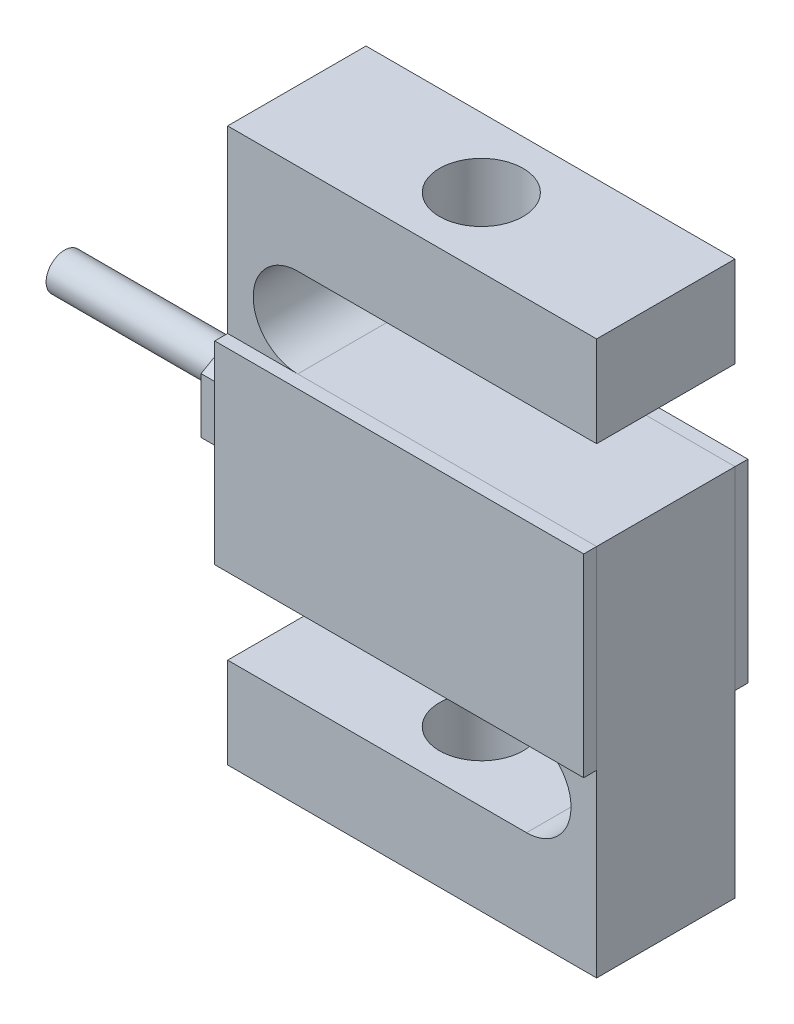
from build123d import *

# Parameters (mm, degrees)
EXTRUDE1_DEPTH               = 9.525
SKETCH2_R                    = 6.35
EXTRUDE2_DEPTH               = 1.5
EXTRUDE3_DEPTH               = 5.08
SKETCH4_R                    = 2.54
EXTRUDE4_DEPTH               = 25.4
F_1_2_20_TAPPED_HOLE1_REACH  = 97.863
F_1_2_20_TAPPED_HOLE1_BORE_R = 5.75437
SKETCH5_W                    = 50.8
SKETCH5_H                    = 26.685
EXTRUDE5_DEPTH               = 1.778
SKETCH7_W                    = 50.8
SKETCH7_H                    = 26.7
EXTRUDE6_DEPTH               = 1.778


with BuildPart() as part:
    # Sketch1 → Extrude1 (new, symmetric)
    with BuildSketch(Plane.XY):
        with BuildLine():
            Line((-25.4, -38.1), (25.4, -38.1))
            Line((25.4, -38.1), (25.4, 13.35))
            Line((25.4, 13.35), (-15.748, 13.35))
            ThreePointArc((-15.748, 13.35), (-21.873, 19.475), (-15.748, 25.6))
            Line((-15.748, 25.6), (25.4, 25.6))
            Line((25.4, 25.6), (25.4, 38.1))
            Line((25.4, 38.1), (-25.4, 38.1))
            Line((-25.4, 38.1), (-25.4, -13.35))
            Line((-25.4, -13.35), (15.748, -13.35))
            ThreePointArc((15.748, -13.35), (21.873, -19.475), (15.748, -25.6))
            Line((15.748, -25.6), (-25.4, -25.6))
            Line((-25.4, -25.6), (-25.4, -38.1))
        make_face()
    extrude(amount=EXTRUDE1_DEPTH, both=True)

    # Sketch2 → Extrude2 (add)
    with BuildSketch(Plane.ZY.offset(25.4)):
        with Locations(Location((0, 0, 0), (0, 0, 90))):
            Circle(SKETCH2_R)
    extrude(amount=EXTRUDE2_DEPTH)

    # Sketch3 → Extrude3 (add)
    with BuildSketch(Plane.ZY.offset(26.9)):
        Polygon((0, 7.62), (-6.599113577, 3.81), (-6.599113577, -3.81), (0, -7.62), (6.599113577, -3.81), (6.599113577, 3.81), align=None)
    extrude(amount=EXTRUDE3_DEPTH)

    # Sketch4 → Extrude4 (add)
    with BuildSketch(Plane.ZY.offset(31.98)):
        Circle(SKETCH4_R)
    extrude(amount=EXTRUDE4_DEPTH)

    # 1_2-20 Tapped Hole1 bore (on position points) → 1_2-20 Tapped Hole1 (cut, up to next)
    with BuildSketch(Plane(origin=(0, 38.1, 0), x_dir=(1, 0, 0), z_dir=(0, 1, 0)), mode=Mode.PRIVATE) as f_1_2_20_tapped_hole1_sk1:
        Circle(F_1_2_20_TAPPED_HOLE1_BORE_R)
    f_1_2_20_tapped_hole1_tool1 = extrude(f_1_2_20_tapped_hole1_sk1.sketch, amount=-F_1_2_20_TAPPED_HOLE1_REACH, mode=Mode.PRIVATE) & part.part
    f_1_2_20_tapped_hole1 = f_1_2_20_tapped_hole1_tool1.solids().sort_by_distance((0, 38.1, 0))[0]
    add(f_1_2_20_tapped_hole1, mode=Mode.SUBTRACT)

    # Mirror1: 1_2-20 Tapped Hole1 across plane
    add(f_1_2_20_tapped_hole1.mirror(Plane.ZX), mode=Mode.SUBTRACT)


with BuildPart() as body_2:
    # Sketch5 → Extrude5 (new body)
    with BuildSketch(Plane.XY.offset(9.525)):
        with Locations((0, 0.0075)):
            Rectangle(SKETCH5_W, SKETCH5_H)
    extrude(amount=EXTRUDE5_DEPTH)


with BuildPart() as body_3:
    # Sketch7 → Extrude6 (new body)
    with BuildSketch(Plane(origin=(0, 0, -9.525), x_dir=(-1, 0, 0), z_dir=(0, 0, -1))):
        Rectangle(SKETCH7_W, SKETCH7_H)
    extrude(amount=EXTRUDE6_DEPTH)


solid = Compound([part.part, body_2.part, body_3.part])
